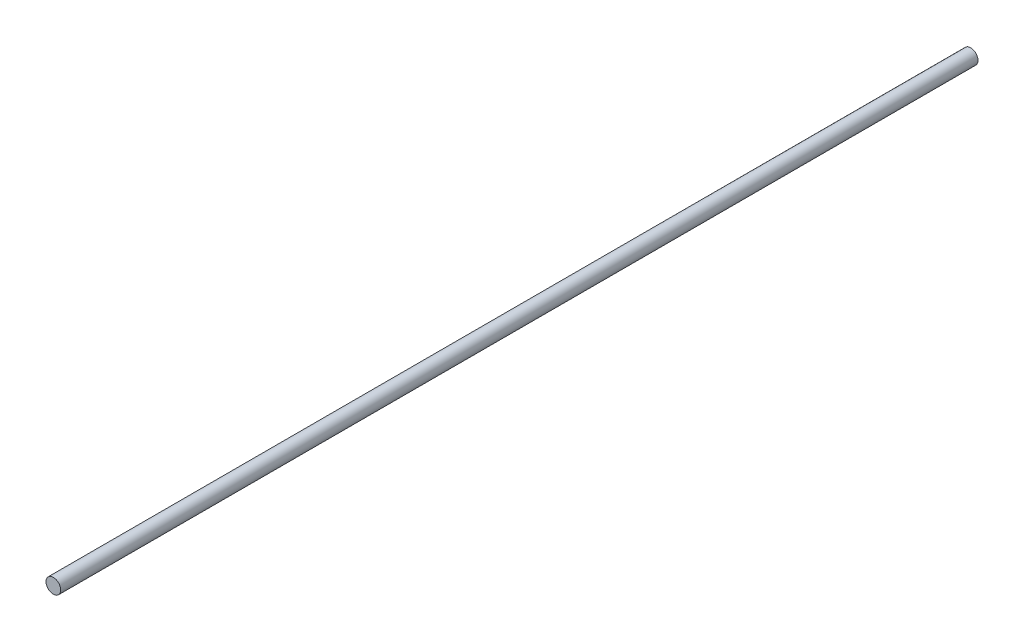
from build123d import *

# Parameters (mm, degrees)
SKETCH1_R           = 8
BOSS_EXTRUDE1_DEPTH = 1000


with BuildPart() as part:
    # Sketch1 → Boss-Extrude1 (new body)
    with BuildSketch(Plane.XY):
        Circle(SKETCH1_R)
    extrude(amount=BOSS_EXTRUDE1_DEPTH)


solid = part.part
